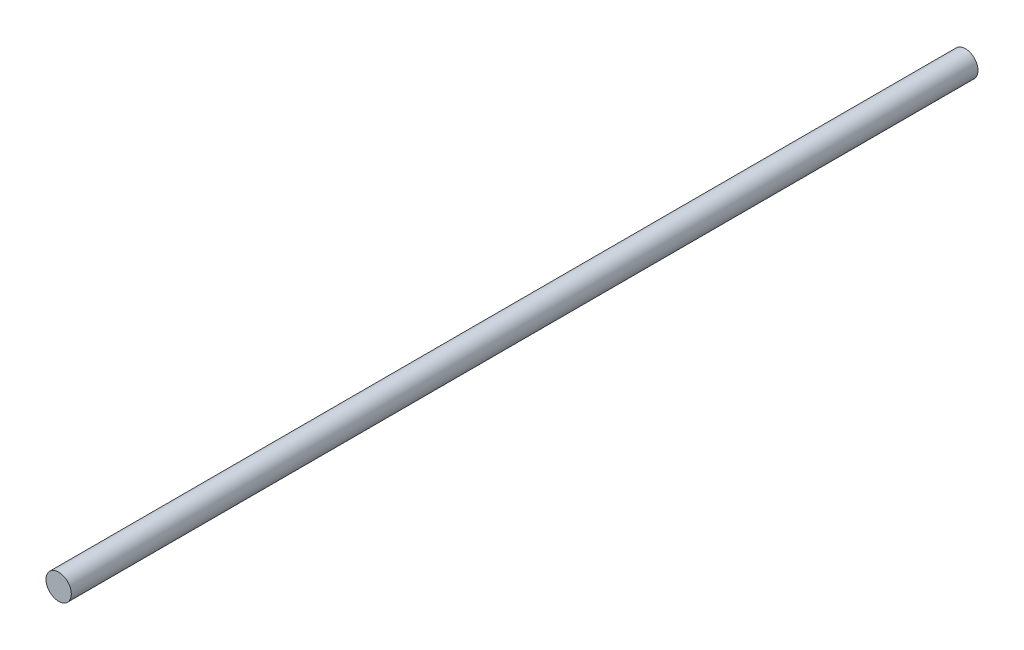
ISO-10303-21;
HEADER;
FILE_DESCRIPTION(('STEP AP214'),'2;1');
FILE_NAME('part.step','',(''),(''),'','','');
FILE_SCHEMA(('AUTOMOTIVE_DESIGN { 1 0 10303 214 1 1 1 1 }'));
ENDSEC;
DATA;
#1=APPLICATION_CONTEXT('core data for automotive mechanical design processes');
#2=APPLICATION_PROTOCOL_DEFINITION('international standard','automotive_design',2000,#1);
#3=PRODUCT_CONTEXT('',#1,'mechanical');
#4=PRODUCT('Part','Part','',(#3));
#5=PRODUCT_RELATED_PRODUCT_CATEGORY('part','',(#4));
#6=PRODUCT_DEFINITION_FORMATION('','',#4);
#7=PRODUCT_DEFINITION_CONTEXT('part definition',#1,'design');
#8=PRODUCT_DEFINITION('design','',#6,#7);
#9=PRODUCT_DEFINITION_SHAPE('','',#8);
#10=(LENGTH_UNIT() NAMED_UNIT(*) SI_UNIT(.MILLI.,.METRE.));
#11=(NAMED_UNIT(*) PLANE_ANGLE_UNIT() SI_UNIT($,.RADIAN.));
#12=(NAMED_UNIT(*) SI_UNIT($,.STERADIAN.) SOLID_ANGLE_UNIT());
#13=UNCERTAINTY_MEASURE_WITH_UNIT(LENGTH_MEASURE(1.E-05),#10,'distance_accuracy_value','');
#14=(GEOMETRIC_REPRESENTATION_CONTEXT(3) GLOBAL_UNCERTAINTY_ASSIGNED_CONTEXT((#13)) GLOBAL_UNIT_ASSIGNED_CONTEXT((#10,
#11,#12)) REPRESENTATION_CONTEXT('',''));
#15=CARTESIAN_POINT('',(0.,0.,0.));
#16=DIRECTION('',(0.,0.,1.));
#17=DIRECTION('',(1.,0.,0.));
#18=AXIS2_PLACEMENT_3D('',#15,#16,#17);
#19=CARTESIAN_POINT('',(0.,0.,70.0024));
#20=DIRECTION('',(0.,0.,-1.));
#21=DIRECTION('',(-1.,0.,0.));
#22=AXIS2_PLACEMENT_3D('',#19,#20,#21);
#23=CYLINDRICAL_SURFACE('',#22,0.9779);
#24=CARTESIAN_POINT('',(0.,0.,70.0024));
#25=DIRECTION('',(0.,0.,1.));
#26=DIRECTION('',(1.,0.,0.));
#27=AXIS2_PLACEMENT_3D('',#24,#25,#26);
#28=CIRCLE('',#27,0.9779);
#29=CARTESIAN_POINT('',(0.9779,0.,70.0024));
#30=VERTEX_POINT('',#29);
#31=EDGE_CURVE('E10',#30,#30,#28,.T.);
#32=ORIENTED_EDGE('',*,*,#31,.F.);
#33=EDGE_LOOP('',(#32));
#34=FACE_BOUND('',#33,.T.);
#35=CARTESIAN_POINT('',(0.,0.,0.));
#36=DIRECTION('',(0.,0.,1.));
#37=DIRECTION('',(1.,0.,0.));
#38=AXIS2_PLACEMENT_3D('',#35,#36,#37);
#39=CIRCLE('',#38,0.9779);
#40=CARTESIAN_POINT('',(0.9779,0.,0.));
#41=VERTEX_POINT('',#40);
#42=EDGE_CURVE('E46',#41,#41,#39,.T.);
#43=ORIENTED_EDGE('',*,*,#42,.T.);
#44=EDGE_LOOP('',(#43));
#45=FACE_BOUND('',#44,.T.);
#46=ADVANCED_FACE('F43',(#34,#45),#23,.T.);
#47=CARTESIAN_POINT('',(0.,0.,70.0024));
#48=DIRECTION('',(0.,0.,1.));
#49=DIRECTION('',(1.,0.,0.));
#50=AXIS2_PLACEMENT_3D('',#47,#48,#49);
#51=PLANE('',#50);
#52=ORIENTED_EDGE('',*,*,#31,.T.);
#53=EDGE_LOOP('',(#52));
#54=FACE_BOUND('',#53,.T.);
#55=ADVANCED_FACE('F60',(#54),#51,.T.);
#56=CARTESIAN_POINT('',(0.,0.,0.));
#57=DIRECTION('',(0.,0.,1.));
#58=DIRECTION('',(1.,0.,0.));
#59=AXIS2_PLACEMENT_3D('',#56,#57,#58);
#60=PLANE('',#59);
#61=ORIENTED_EDGE('',*,*,#42,.F.);
#62=EDGE_LOOP('',(#61));
#63=FACE_BOUND('',#62,.T.);
#64=ADVANCED_FACE('F58',(#63),#60,.F.);
#65=CLOSED_SHELL('',(#46,#55,#64));
#66=MANIFOLD_SOLID_BREP('B2',#65);
#67=ADVANCED_BREP_SHAPE_REPRESENTATION('',(#18,#66),#14);
#68=SHAPE_DEFINITION_REPRESENTATION(#9,#67);
ENDSEC;
END-ISO-10303-21;
